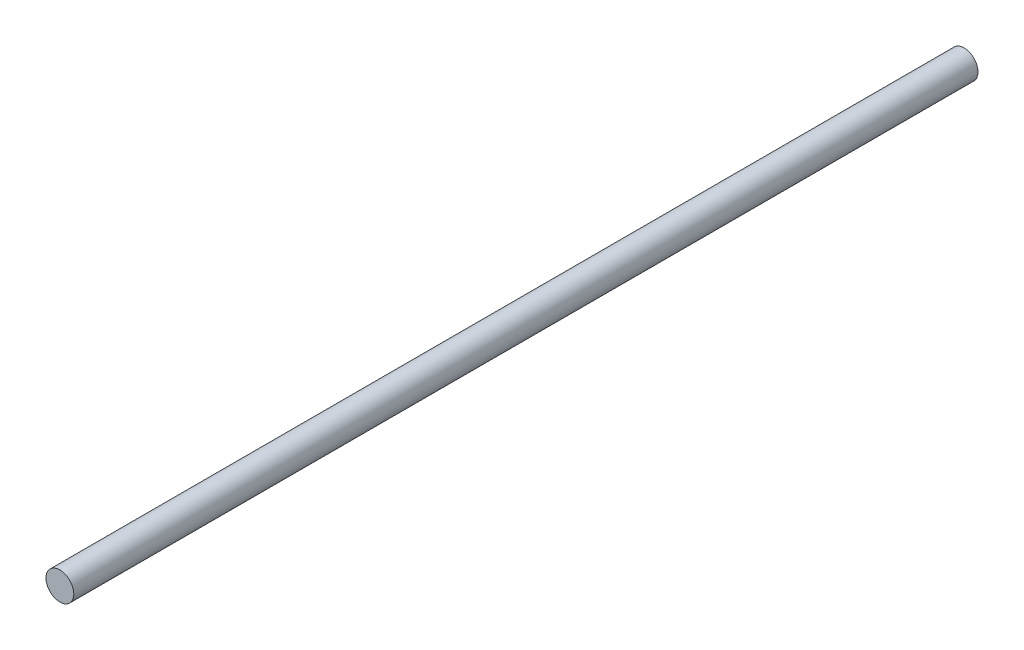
from build123d import *

# Parameters (mm, degrees)
SKETCH1_R           = 30
BOSS_EXTRUDE1_DEPTH = 1950


with BuildPart() as part:
    # Sketch1 → Boss-Extrude1 (new body)
    with BuildSketch(Plane.XY):
        Circle(SKETCH1_R)
    extrude(amount=-BOSS_EXTRUDE1_DEPTH)


solid = part.part
